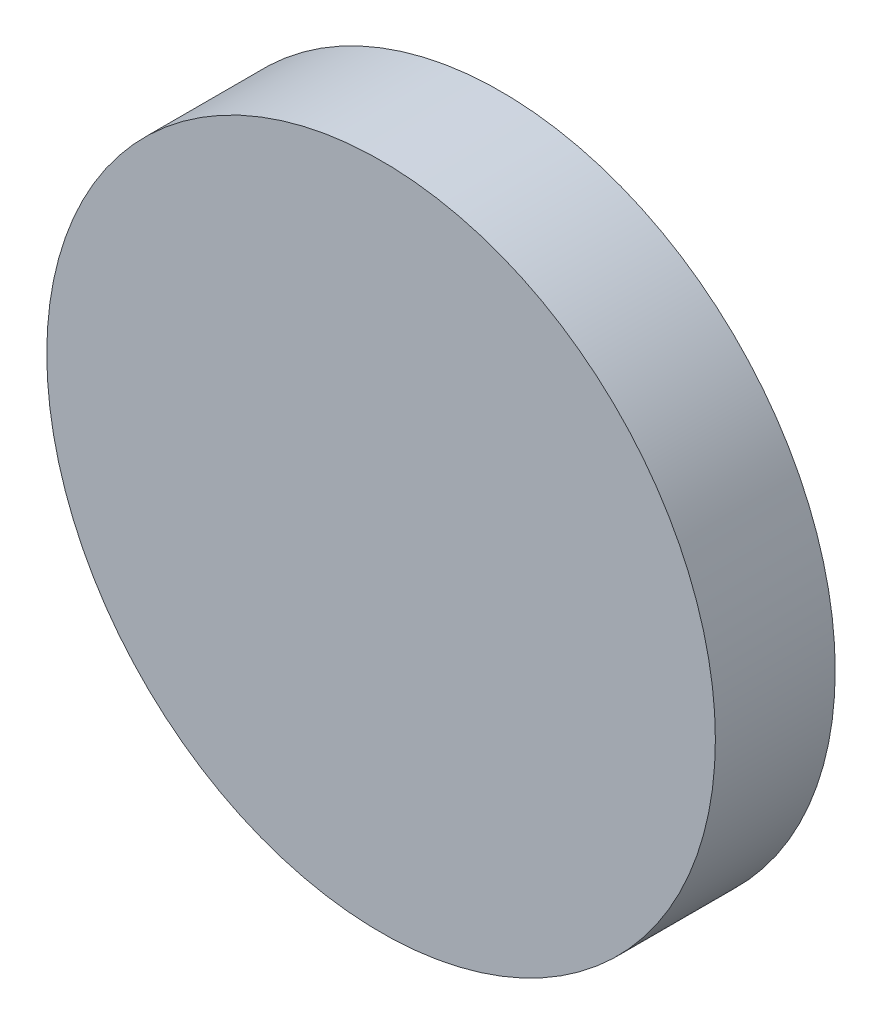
ISO-10303-21;
HEADER;
FILE_DESCRIPTION(('STEP AP214'),'2;1');
FILE_NAME('part.step','',(''),(''),'','','');
FILE_SCHEMA(('AUTOMOTIVE_DESIGN { 1 0 10303 214 1 1 1 1 }'));
ENDSEC;
DATA;
#1=APPLICATION_CONTEXT('core data for automotive mechanical design processes');
#2=APPLICATION_PROTOCOL_DEFINITION('international standard','automotive_design',2000,#1);
#3=PRODUCT_CONTEXT('',#1,'mechanical');
#4=PRODUCT('Part','Part','',(#3));
#5=PRODUCT_RELATED_PRODUCT_CATEGORY('part','',(#4));
#6=PRODUCT_DEFINITION_FORMATION('','',#4);
#7=PRODUCT_DEFINITION_CONTEXT('part definition',#1,'design');
#8=PRODUCT_DEFINITION('design','',#6,#7);
#9=PRODUCT_DEFINITION_SHAPE('','',#8);
#10=(LENGTH_UNIT() NAMED_UNIT(*) SI_UNIT(.MILLI.,.METRE.));
#11=(NAMED_UNIT(*) PLANE_ANGLE_UNIT() SI_UNIT($,.RADIAN.));
#12=(NAMED_UNIT(*) SI_UNIT($,.STERADIAN.) SOLID_ANGLE_UNIT());
#13=UNCERTAINTY_MEASURE_WITH_UNIT(LENGTH_MEASURE(1.E-05),#10,'distance_accuracy_value','');
#14=(GEOMETRIC_REPRESENTATION_CONTEXT(3) GLOBAL_UNCERTAINTY_ASSIGNED_CONTEXT((#13)) GLOBAL_UNIT_ASSIGNED_CONTEXT((#10,
#11,#12)) REPRESENTATION_CONTEXT('',''));
#15=CARTESIAN_POINT('',(0.,0.,0.));
#16=DIRECTION('',(0.,0.,1.));
#17=DIRECTION('',(1.,0.,0.));
#18=AXIS2_PLACEMENT_3D('',#15,#16,#17);
#19=CARTESIAN_POINT('',(0.,0.,1.9));
#20=DIRECTION('',(0.,0.,-1.));
#21=DIRECTION('',(-1.,0.,0.));
#22=AXIS2_PLACEMENT_3D('',#19,#20,#21);
#23=CYLINDRICAL_SURFACE('',#22,5.3);
#24=CARTESIAN_POINT('',(0.,0.,1.9));
#25=DIRECTION('',(0.,0.,1.));
#26=DIRECTION('',(1.,0.,0.));
#27=AXIS2_PLACEMENT_3D('',#24,#25,#26);
#28=CIRCLE('',#27,5.3);
#29=CARTESIAN_POINT('',(-5.3,0.,1.9));
#30=VERTEX_POINT('',#29);
#31=EDGE_CURVE('E10',#30,#30,#28,.T.);
#32=CARTESIAN_POINT('',(0.,0.,0.));
#33=DIRECTION('',(0.,0.,1.));
#34=DIRECTION('',(1.,0.,0.));
#35=AXIS2_PLACEMENT_3D('',#32,#33,#34);
#36=CIRCLE('',#35,5.3);
#37=CARTESIAN_POINT('',(-5.3,0.,0.));
#38=VERTEX_POINT('',#37);
#39=EDGE_CURVE('E34',#38,#38,#36,.T.);
#40=CARTESIAN_POINT('',(-5.3,0.,1.9));
#41=CARTESIAN_POINT('',(-5.3,0.,1.88020833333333));
#42=CARTESIAN_POINT('',(-5.3,0.,1.86041666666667));
#43=CARTESIAN_POINT('',(-5.3,0.,1.82083333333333));
#44=CARTESIAN_POINT('',(-5.3,0.,1.80104166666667));
#45=CARTESIAN_POINT('',(-5.3,0.,1.76145833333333));
#46=CARTESIAN_POINT('',(-5.3,0.,1.74166666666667));
#47=CARTESIAN_POINT('',(-5.3,0.,1.70208333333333));
#48=CARTESIAN_POINT('',(-5.3,0.,1.68229166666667));
#49=CARTESIAN_POINT('',(-5.3,0.,1.64270833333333));
#50=CARTESIAN_POINT('',(-5.3,0.,1.62291666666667));
#51=CARTESIAN_POINT('',(-5.3,0.,1.58333333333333));
#52=CARTESIAN_POINT('',(-5.3,0.,1.56354166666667));
#53=CARTESIAN_POINT('',(-5.3,0.,1.52395833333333));
#54=CARTESIAN_POINT('',(-5.3,0.,1.50416666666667));
#55=CARTESIAN_POINT('',(-5.3,0.,1.46458333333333));
#56=CARTESIAN_POINT('',(-5.3,0.,1.44479166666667));
#57=CARTESIAN_POINT('',(-5.3,0.,1.40520833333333));
#58=CARTESIAN_POINT('',(-5.3,0.,1.38541666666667));
#59=CARTESIAN_POINT('',(-5.3,0.,1.34583333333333));
#60=CARTESIAN_POINT('',(-5.3,0.,1.32604166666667));
#61=CARTESIAN_POINT('',(-5.3,0.,1.28645833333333));
#62=CARTESIAN_POINT('',(-5.3,0.,1.26666666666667));
#63=CARTESIAN_POINT('',(-5.3,0.,1.22708333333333));
#64=CARTESIAN_POINT('',(-5.3,0.,1.20729166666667));
#65=CARTESIAN_POINT('',(-5.3,0.,1.16770833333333));
#66=CARTESIAN_POINT('',(-5.3,0.,1.14791666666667));
#67=CARTESIAN_POINT('',(-5.3,0.,1.10833333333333));
#68=CARTESIAN_POINT('',(-5.3,0.,1.08854166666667));
#69=CARTESIAN_POINT('',(-5.3,0.,1.04895833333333));
#70=CARTESIAN_POINT('',(-5.3,0.,1.02916666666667));
#71=CARTESIAN_POINT('',(-5.3,0.,0.989583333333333));
#72=CARTESIAN_POINT('',(-5.3,0.,0.969791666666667));
#73=CARTESIAN_POINT('',(-5.3,0.,0.930208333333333));
#74=CARTESIAN_POINT('',(-5.3,0.,0.910416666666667));
#75=CARTESIAN_POINT('',(-5.3,0.,0.870833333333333));
#76=CARTESIAN_POINT('',(-5.3,0.,0.851041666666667));
#77=CARTESIAN_POINT('',(-5.3,0.,0.811458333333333));
#78=CARTESIAN_POINT('',(-5.3,0.,0.791666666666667));
#79=CARTESIAN_POINT('',(-5.3,0.,0.752083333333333));
#80=CARTESIAN_POINT('',(-5.3,0.,0.732291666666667));
#81=CARTESIAN_POINT('',(-5.3,0.,0.692708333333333));
#82=CARTESIAN_POINT('',(-5.3,0.,0.672916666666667));
#83=CARTESIAN_POINT('',(-5.3,0.,0.633333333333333));
#84=CARTESIAN_POINT('',(-5.3,0.,0.613541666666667));
#85=CARTESIAN_POINT('',(-5.3,0.,0.573958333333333));
#86=CARTESIAN_POINT('',(-5.3,0.,0.554166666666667));
#87=CARTESIAN_POINT('',(-5.3,0.,0.514583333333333));
#88=CARTESIAN_POINT('',(-5.3,0.,0.494791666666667));
#89=CARTESIAN_POINT('',(-5.3,0.,0.455208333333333));
#90=CARTESIAN_POINT('',(-5.3,0.,0.435416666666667));
#91=CARTESIAN_POINT('',(-5.3,0.,0.395833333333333));
#92=CARTESIAN_POINT('',(-5.3,0.,0.376041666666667));
#93=CARTESIAN_POINT('',(-5.3,0.,0.336458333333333));
#94=CARTESIAN_POINT('',(-5.3,0.,0.316666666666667));
#95=CARTESIAN_POINT('',(-5.3,0.,0.277083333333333));
#96=CARTESIAN_POINT('',(-5.3,0.,0.257291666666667));
#97=CARTESIAN_POINT('',(-5.3,0.,0.217708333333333));
#98=CARTESIAN_POINT('',(-5.3,0.,0.197916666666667));
#99=CARTESIAN_POINT('',(-5.3,0.,0.158333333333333));
#100=CARTESIAN_POINT('',(-5.3,0.,0.138541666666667));
#101=CARTESIAN_POINT('',(-5.3,0.,0.0989583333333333));
#102=CARTESIAN_POINT('',(-5.3,0.,0.0791666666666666));
#103=CARTESIAN_POINT('',(-5.3,0.,0.0395833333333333));
#104=CARTESIAN_POINT('',(-5.3,0.,0.0197916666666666));
#105=CARTESIAN_POINT('',(-5.3,0.,0.));
#106=B_SPLINE_CURVE_WITH_KNOTS('',3,(#40,#41,#42,#43,#44,#45,#46,#47,#48,#49,#50,#51,#52,#53,
#54,#55,#56,#57,#58,#59,#60,#61,#62,#63,#64,#65,#66,#67,#68,#69,#70,#71,#72,#73,#74,#75,#76,#77,
#78,#79,#80,#81,#82,#83,#84,#85,#86,#87,#88,#89,#90,#91,#92,#93,#94,#95,#96,#97,#98,#99,#100,
#101,#102,#103,#104,#105),.UNSPECIFIED.,.F.,.F.,(4,2,2,2,2,2,2,2,2,2,2,2,2,2,2,2,2,2,2,2,2,2,2,
2,2,2,2,2,2,2,2,2,4),(0.,0.059375,0.11875,0.178125,0.2375,0.296875,0.35625,0.415625,0.475,
0.534375,0.59375,0.653125,0.7125,0.771875,0.83125,0.890625,0.95,1.009375,1.06875,1.128125,
1.1875,1.246875,1.30625,1.365625,1.425,1.484375,1.54375,1.603125,1.6625,1.721875,1.78125,
1.840625,1.9),.UNSPECIFIED.);
#107=EDGE_CURVE('BSEAM31',#30,#38,#106,.T.);
#108=ORIENTED_EDGE('',*,*,#31,.F.);
#109=ORIENTED_EDGE('',*,*,#39,.T.);
#110=ORIENTED_EDGE('',*,*,#107,.T.);
#111=ORIENTED_EDGE('',*,*,#107,.F.);
#112=EDGE_LOOP('',(#108,#110,#109,#111));
#113=FACE_BOUND('',#112,.T.);
#114=ADVANCED_FACE('F31',(#113),#23,.T.);
#115=CARTESIAN_POINT('',(0.,0.,1.9));
#116=DIRECTION('',(0.,0.,1.));
#117=DIRECTION('',(1.,0.,0.));
#118=AXIS2_PLACEMENT_3D('',#115,#116,#117);
#119=PLANE('',#118);
#120=ORIENTED_EDGE('',*,*,#31,.T.);
#121=EDGE_LOOP('',(#120));
#122=FACE_BOUND('',#121,.T.);
#123=ADVANCED_FACE('F46',(#122),#119,.T.);
#124=CARTESIAN_POINT('',(0.,0.,0.));
#125=DIRECTION('',(0.,0.,1.));
#126=DIRECTION('',(1.,0.,0.));
#127=AXIS2_PLACEMENT_3D('',#124,#125,#126);
#128=PLANE('',#127);
#129=ORIENTED_EDGE('',*,*,#39,.F.);
#130=EDGE_LOOP('',(#129));
#131=FACE_BOUND('',#130,.T.);
#132=ADVANCED_FACE('F44',(#131),#128,.F.);
#133=CLOSED_SHELL('',(#114,#123,#132));
#134=MANIFOLD_SOLID_BREP('B2',#133);
#135=ADVANCED_BREP_SHAPE_REPRESENTATION('',(#18,#134),#14);
#136=SHAPE_DEFINITION_REPRESENTATION(#9,#135);
ENDSEC;
END-ISO-10303-21;
